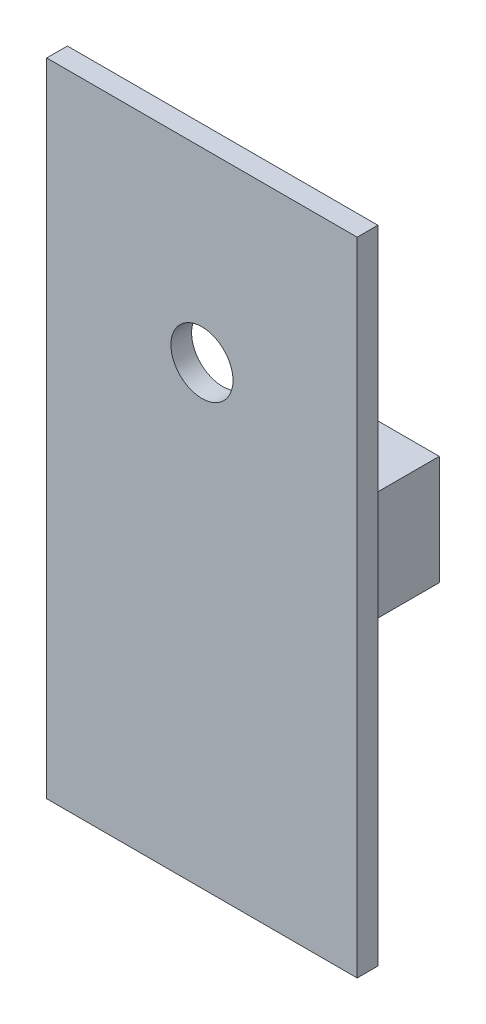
ISO-10303-21;
HEADER;
FILE_DESCRIPTION(('STEP AP214'),'2;1');
FILE_NAME('part.step','',(''),(''),'','','');
FILE_SCHEMA(('AUTOMOTIVE_DESIGN { 1 0 10303 214 1 1 1 1 }'));
ENDSEC;
DATA;
#1=APPLICATION_CONTEXT('core data for automotive mechanical design processes');
#2=APPLICATION_PROTOCOL_DEFINITION('international standard','automotive_design',2000,#1);
#3=PRODUCT_CONTEXT('',#1,'mechanical');
#4=PRODUCT('Part','Part','',(#3));
#5=PRODUCT_RELATED_PRODUCT_CATEGORY('part','',(#4));
#6=PRODUCT_DEFINITION_FORMATION('','',#4);
#7=PRODUCT_DEFINITION_CONTEXT('part definition',#1,'design');
#8=PRODUCT_DEFINITION('design','',#6,#7);
#9=PRODUCT_DEFINITION_SHAPE('','',#8);
#10=(LENGTH_UNIT() NAMED_UNIT(*) SI_UNIT(.MILLI.,.METRE.));
#11=(NAMED_UNIT(*) PLANE_ANGLE_UNIT() SI_UNIT($,.RADIAN.));
#12=(NAMED_UNIT(*) SI_UNIT($,.STERADIAN.) SOLID_ANGLE_UNIT());
#13=UNCERTAINTY_MEASURE_WITH_UNIT(LENGTH_MEASURE(1.E-05),#10,'distance_accuracy_value','');
#14=(GEOMETRIC_REPRESENTATION_CONTEXT(3) GLOBAL_UNCERTAINTY_ASSIGNED_CONTEXT((#13)) GLOBAL_UNIT_ASSIGNED_CONTEXT((#10,
#11,#12)) REPRESENTATION_CONTEXT('',''));
#15=CARTESIAN_POINT('',(0.,0.,0.));
#16=DIRECTION('',(0.,0.,1.));
#17=DIRECTION('',(1.,0.,0.));
#18=AXIS2_PLACEMENT_3D('',#15,#16,#17);
#19=CARTESIAN_POINT('',(0.,0.,0.));
#20=DIRECTION('',(0.,0.,1.));
#21=DIRECTION('',(1.,0.,0.));
#22=AXIS2_PLACEMENT_3D('',#19,#20,#21);
#23=PLANE('',#22);
#24=CARTESIAN_POINT('',(-0.516055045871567,-4.4243119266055,0.));
#25=DIRECTION('',(0.,0.,1.));
#26=DIRECTION('',(1.,0.,0.));
#27=AXIS2_PLACEMENT_3D('',#24,#25,#26);
#28=CIRCLE('',#27,1.5);
#29=CARTESIAN_POINT('',(0.983944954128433,-4.4243119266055,0.));
#30=VERTEX_POINT('',#29);
#31=EDGE_CURVE('E121',#30,#30,#28,.T.);
#32=ORIENTED_EDGE('',*,*,#31,.T.);
#33=EDGE_LOOP('',(#32));
#34=FACE_BOUND('',#33,.T.);
#35=DIRECTION('',(0.,-1.,0.));
#36=VECTOR('',#35,1.);
#37=CARTESIAN_POINT('',(-8.01605504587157,4.5756880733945,0.));
#38=LINE('',#37,#36);
#39=CARTESIAN_POINT('',(-8.01605504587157,4.5756880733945,0.));
#40=VERTEX_POINT('',#39);
#41=CARTESIAN_POINT('',(-8.01605504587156,-26.4243119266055,0.));
#42=VERTEX_POINT('',#41);
#43=EDGE_CURVE('E131',#40,#42,#38,.T.);
#44=ORIENTED_EDGE('',*,*,#43,.F.);
#45=DIRECTION('',(-1.,0.,0.));
#46=VECTOR('',#45,1.);
#47=CARTESIAN_POINT('',(-8.01605504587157,4.5756880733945,0.));
#48=LINE('',#47,#46);
#49=CARTESIAN_POINT('',(6.98394495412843,4.5756880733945,0.));
#50=VERTEX_POINT('',#49);
#51=EDGE_CURVE('E137',#50,#40,#48,.T.);
#52=ORIENTED_EDGE('',*,*,#51,.F.);
#53=DIRECTION('',(0.,1.,0.));
#54=VECTOR('',#53,1.);
#55=CARTESIAN_POINT('',(6.98394495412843,4.5756880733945,0.));
#56=LINE('',#55,#54);
#57=CARTESIAN_POINT('',(6.98394495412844,-26.4243119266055,0.));
#58=VERTEX_POINT('',#57);
#59=EDGE_CURVE('E148',#58,#50,#56,.T.);
#60=ORIENTED_EDGE('',*,*,#59,.F.);
#61=DIRECTION('',(1.,0.,0.));
#62=VECTOR('',#61,1.);
#63=CARTESIAN_POINT('',(-8.01605504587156,-26.4243119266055,0.));
#64=LINE('',#63,#62);
#65=EDGE_CURVE('E146',#42,#58,#64,.T.);
#66=ORIENTED_EDGE('',*,*,#65,.F.);
#67=EDGE_LOOP('',(#44,#52,#60,#66));
#68=FACE_BOUND('',#67,.T.);
#69=DIRECTION('',(0.,-1.,0.));
#70=VECTOR('',#69,1.);
#71=CARTESIAN_POINT('',(5.95187512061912,-7.61131936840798,0.));
#72=LINE('',#71,#70);
#73=CARTESIAN_POINT('',(5.95187512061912,-7.61131936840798,0.));
#74=VERTEX_POINT('',#73);
#75=CARTESIAN_POINT('',(5.95187512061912,-12.8970993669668,0.));
#76=VERTEX_POINT('',#75);
#77=EDGE_CURVE('E120',#74,#76,#72,.T.);
#78=ORIENTED_EDGE('',*,*,#77,.F.);
#79=DIRECTION('',(1.,0.,0.));
#80=VECTOR('',#79,1.);
#81=CARTESIAN_POINT('',(5.95187512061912,-7.61131936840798,0.));
#82=LINE('',#81,#80);
#83=CARTESIAN_POINT('',(1.08613818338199,-7.61131936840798,0.));
#84=VERTEX_POINT('',#83);
#85=EDGE_CURVE('E117',#84,#74,#82,.T.);
#86=ORIENTED_EDGE('',*,*,#85,.F.);
#87=DIRECTION('',(0.,1.,0.));
#88=VECTOR('',#87,1.);
#89=CARTESIAN_POINT('',(1.08613818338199,-7.61131936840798,0.));
#90=LINE('',#89,#88);
#91=CARTESIAN_POINT('',(1.08613818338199,-12.8970993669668,0.));
#92=VERTEX_POINT('',#91);
#93=EDGE_CURVE('E55',#92,#84,#90,.T.);
#94=ORIENTED_EDGE('',*,*,#93,.F.);
#95=DIRECTION('',(-1.,0.,0.));
#96=VECTOR('',#95,1.);
#97=CARTESIAN_POINT('',(5.95187512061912,-12.8970993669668,0.));
#98=LINE('',#97,#96);
#99=EDGE_CURVE('E50',#76,#92,#98,.T.);
#100=ORIENTED_EDGE('',*,*,#99,.F.);
#101=EDGE_LOOP('',(#78,#86,#94,#100));
#102=FACE_BOUND('',#101,.T.);
#103=ADVANCED_FACE('F35',(#34,#68,#102),#23,.F.);
#104=CARTESIAN_POINT('',(0.,0.,1.));
#105=DIRECTION('',(0.,0.,1.));
#106=DIRECTION('',(1.,0.,0.));
#107=AXIS2_PLACEMENT_3D('',#104,#105,#106);
#108=PLANE('',#107);
#109=DIRECTION('',(0.,-1.,0.));
#110=VECTOR('',#109,1.);
#111=CARTESIAN_POINT('',(-8.01605504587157,4.5756880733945,1.));
#112=LINE('',#111,#110);
#113=CARTESIAN_POINT('',(-8.01605504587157,4.5756880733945,1.));
#114=VERTEX_POINT('',#113);
#115=CARTESIAN_POINT('',(-8.01605504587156,-26.4243119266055,1.));
#116=VERTEX_POINT('',#115);
#117=EDGE_CURVE('E133',#114,#116,#112,.T.);
#118=ORIENTED_EDGE('',*,*,#117,.T.);
#119=DIRECTION('',(1.,0.,0.));
#120=VECTOR('',#119,1.);
#121=CARTESIAN_POINT('',(-8.01605504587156,-26.4243119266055,1.));
#122=LINE('',#121,#120);
#123=CARTESIAN_POINT('',(6.98394495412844,-26.4243119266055,1.));
#124=VERTEX_POINT('',#123);
#125=EDGE_CURVE('E136',#116,#124,#122,.T.);
#126=ORIENTED_EDGE('',*,*,#125,.T.);
#127=DIRECTION('',(0.,1.,0.));
#128=VECTOR('',#127,1.);
#129=CARTESIAN_POINT('',(6.98394495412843,4.5756880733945,1.));
#130=LINE('',#129,#128);
#131=CARTESIAN_POINT('',(6.98394495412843,4.5756880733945,1.));
#132=VERTEX_POINT('',#131);
#133=EDGE_CURVE('E139',#124,#132,#130,.T.);
#134=ORIENTED_EDGE('',*,*,#133,.T.);
#135=DIRECTION('',(-1.,0.,0.));
#136=VECTOR('',#135,1.);
#137=CARTESIAN_POINT('',(-8.01605504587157,4.5756880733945,1.));
#138=LINE('',#137,#136);
#139=EDGE_CURVE('E141',#132,#114,#138,.T.);
#140=ORIENTED_EDGE('',*,*,#139,.T.);
#141=EDGE_LOOP('',(#118,#126,#134,#140));
#142=FACE_BOUND('',#141,.T.);
#143=CARTESIAN_POINT('',(-0.516055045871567,-4.4243119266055,1.));
#144=DIRECTION('',(0.,0.,1.));
#145=DIRECTION('',(1.,0.,0.));
#146=AXIS2_PLACEMENT_3D('',#143,#144,#145);
#147=CIRCLE('',#146,1.5);
#148=CARTESIAN_POINT('',(0.983944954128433,-4.4243119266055,1.));
#149=VERTEX_POINT('',#148);
#150=EDGE_CURVE('E124',#149,#149,#147,.T.);
#151=ORIENTED_EDGE('',*,*,#150,.F.);
#152=EDGE_LOOP('',(#151));
#153=FACE_BOUND('',#152,.T.);
#154=ADVANCED_FACE('F174',(#142,#153),#108,.T.);
#155=CARTESIAN_POINT('',(-8.01605504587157,4.5756880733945,1.));
#156=DIRECTION('',(1.,0.,0.));
#157=DIRECTION('',(0.,1.,0.));
#158=AXIS2_PLACEMENT_3D('',#155,#156,#157);
#159=PLANE('',#158);
#160=ORIENTED_EDGE('',*,*,#43,.T.);
#161=DIRECTION('',(0.,0.,-1.));
#162=VECTOR('',#161,1.);
#163=CARTESIAN_POINT('',(-8.01605504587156,-26.4243119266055,1.));
#164=LINE('',#163,#162);
#165=EDGE_CURVE('E11',#116,#42,#164,.T.);
#166=ORIENTED_EDGE('',*,*,#165,.F.);
#167=ORIENTED_EDGE('',*,*,#117,.F.);
#168=DIRECTION('',(0.,0.,-1.));
#169=VECTOR('',#168,1.);
#170=CARTESIAN_POINT('',(-8.01605504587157,4.5756880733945,1.));
#171=LINE('',#170,#169);
#172=EDGE_CURVE('E143',#114,#40,#171,.T.);
#173=ORIENTED_EDGE('',*,*,#172,.T.);
#174=EDGE_LOOP('',(#160,#166,#167,#173));
#175=FACE_BOUND('',#174,.T.);
#176=ADVANCED_FACE('F37',(#175),#159,.F.);
#177=CARTESIAN_POINT('',(-8.01605504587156,-26.4243119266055,1.));
#178=DIRECTION('',(0.,1.,0.));
#179=DIRECTION('',(0.,0.,1.));
#180=AXIS2_PLACEMENT_3D('',#177,#178,#179);
#181=PLANE('',#180);
#182=ORIENTED_EDGE('',*,*,#65,.T.);
#183=DIRECTION('',(0.,0.,-1.));
#184=VECTOR('',#183,1.);
#185=CARTESIAN_POINT('',(6.98394495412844,-26.4243119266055,1.));
#186=LINE('',#185,#184);
#187=EDGE_CURVE('E43',#124,#58,#186,.T.);
#188=ORIENTED_EDGE('',*,*,#187,.F.);
#189=ORIENTED_EDGE('',*,*,#125,.F.);
#190=ORIENTED_EDGE('',*,*,#165,.T.);
#191=EDGE_LOOP('',(#182,#188,#189,#190));
#192=FACE_BOUND('',#191,.T.);
#193=ADVANCED_FACE('F176',(#192),#181,.F.);
#194=CARTESIAN_POINT('',(6.98394495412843,4.5756880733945,1.));
#195=DIRECTION('',(-1.,0.,0.));
#196=DIRECTION('',(0.,-1.,0.));
#197=AXIS2_PLACEMENT_3D('',#194,#195,#196);
#198=PLANE('',#197);
#199=ORIENTED_EDGE('',*,*,#59,.T.);
#200=DIRECTION('',(0.,0.,-1.));
#201=VECTOR('',#200,1.);
#202=CARTESIAN_POINT('',(6.98394495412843,4.5756880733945,1.));
#203=LINE('',#202,#201);
#204=EDGE_CURVE('E153',#132,#50,#203,.T.);
#205=ORIENTED_EDGE('',*,*,#204,.F.);
#206=ORIENTED_EDGE('',*,*,#133,.F.);
#207=ORIENTED_EDGE('',*,*,#187,.T.);
#208=EDGE_LOOP('',(#199,#205,#206,#207));
#209=FACE_BOUND('',#208,.T.);
#210=ADVANCED_FACE('F160',(#209),#198,.F.);
#211=CARTESIAN_POINT('',(-8.01605504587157,4.5756880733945,1.));
#212=DIRECTION('',(0.,-1.,0.));
#213=DIRECTION('',(0.,0.,-1.));
#214=AXIS2_PLACEMENT_3D('',#211,#212,#213);
#215=PLANE('',#214);
#216=ORIENTED_EDGE('',*,*,#51,.T.);
#217=ORIENTED_EDGE('',*,*,#172,.F.);
#218=ORIENTED_EDGE('',*,*,#139,.F.);
#219=ORIENTED_EDGE('',*,*,#204,.T.);
#220=EDGE_LOOP('',(#216,#217,#218,#219));
#221=FACE_BOUND('',#220,.T.);
#222=ADVANCED_FACE('F168',(#221),#215,.F.);
#223=CARTESIAN_POINT('',(-0.516055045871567,-4.4243119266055,1.));
#224=DIRECTION('',(0.,0.,-1.));
#225=DIRECTION('',(-1.,0.,0.));
#226=AXIS2_PLACEMENT_3D('',#223,#224,#225);
#227=CYLINDRICAL_SURFACE('',#226,1.5);
#228=ORIENTED_EDGE('',*,*,#150,.T.);
#229=EDGE_LOOP('',(#228));
#230=FACE_BOUND('',#229,.T.);
#231=ORIENTED_EDGE('',*,*,#31,.F.);
#232=EDGE_LOOP('',(#231));
#233=FACE_BOUND('',#232,.T.);
#234=ADVANCED_FACE('F193',(#230,#233),#227,.F.);
#235=CARTESIAN_POINT('',(5.95187512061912,-7.61131936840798,-4.));
#236=DIRECTION('',(-1.,0.,0.));
#237=DIRECTION('',(0.,0.,1.));
#238=AXIS2_PLACEMENT_3D('',#235,#236,#237);
#239=PLANE('',#238);
#240=ORIENTED_EDGE('',*,*,#77,.T.);
#241=DIRECTION('',(0.,0.,1.));
#242=VECTOR('',#241,1.);
#243=CARTESIAN_POINT('',(5.95187512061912,-12.8970993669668,-4.));
#244=LINE('',#243,#242);
#245=CARTESIAN_POINT('',(5.95187512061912,-12.8970993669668,-4.));
#246=VERTEX_POINT('',#245);
#247=EDGE_CURVE('E101',#246,#76,#244,.T.);
#248=ORIENTED_EDGE('',*,*,#247,.F.);
#249=DIRECTION('',(0.,-1.,0.));
#250=VECTOR('',#249,1.);
#251=CARTESIAN_POINT('',(5.95187512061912,-7.61131936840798,-4.));
#252=LINE('',#251,#250);
#253=CARTESIAN_POINT('',(5.95187512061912,-7.61131936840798,-4.));
#254=VERTEX_POINT('',#253);
#255=EDGE_CURVE('E108',#254,#246,#252,.T.);
#256=ORIENTED_EDGE('',*,*,#255,.F.);
#257=DIRECTION('',(0.,0.,1.));
#258=VECTOR('',#257,1.);
#259=CARTESIAN_POINT('',(5.95187512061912,-7.61131936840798,-4.));
#260=LINE('',#259,#258);
#261=EDGE_CURVE('E281',#254,#74,#260,.T.);
#262=ORIENTED_EDGE('',*,*,#261,.T.);
#263=EDGE_LOOP('',(#240,#248,#256,#262));
#264=FACE_BOUND('',#263,.T.);
#265=ADVANCED_FACE('F119',(#264),#239,.F.);
#266=CARTESIAN_POINT('',(5.95187512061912,-12.8970993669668,-4.));
#267=DIRECTION('',(0.,1.,0.));
#268=DIRECTION('',(0.,0.,1.));
#269=AXIS2_PLACEMENT_3D('',#266,#267,#268);
#270=PLANE('',#269);
#271=ORIENTED_EDGE('',*,*,#99,.T.);
#272=DIRECTION('',(0.,0.,1.));
#273=VECTOR('',#272,1.);
#274=CARTESIAN_POINT('',(1.08613818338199,-12.8970993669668,-4.));
#275=LINE('',#274,#273);
#276=CARTESIAN_POINT('',(1.08613818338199,-12.8970993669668,-4.));
#277=VERTEX_POINT('',#276);
#278=EDGE_CURVE('E104',#277,#92,#275,.T.);
#279=ORIENTED_EDGE('',*,*,#278,.F.);
#280=DIRECTION('',(-1.,0.,0.));
#281=VECTOR('',#280,1.);
#282=CARTESIAN_POINT('',(5.95187512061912,-12.8970993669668,-4.));
#283=LINE('',#282,#281);
#284=EDGE_CURVE('E97',#246,#277,#283,.T.);
#285=ORIENTED_EDGE('',*,*,#284,.F.);
#286=ORIENTED_EDGE('',*,*,#247,.T.);
#287=EDGE_LOOP('',(#271,#279,#285,#286));
#288=FACE_BOUND('',#287,.T.);
#289=ADVANCED_FACE('F99',(#288),#270,.F.);
#290=CARTESIAN_POINT('',(1.08613818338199,-7.61131936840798,-4.));
#291=DIRECTION('',(1.,0.,0.));
#292=DIRECTION('',(0.,0.,-1.));
#293=AXIS2_PLACEMENT_3D('',#290,#291,#292);
#294=PLANE('',#293);
#295=ORIENTED_EDGE('',*,*,#93,.T.);
#296=DIRECTION('',(0.,0.,1.));
#297=VECTOR('',#296,1.);
#298=CARTESIAN_POINT('',(1.08613818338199,-7.61131936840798,-4.));
#299=LINE('',#298,#297);
#300=CARTESIAN_POINT('',(1.08613818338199,-7.61131936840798,-4.));
#301=VERTEX_POINT('',#300);
#302=EDGE_CURVE('E126',#301,#84,#299,.T.);
#303=ORIENTED_EDGE('',*,*,#302,.F.);
#304=DIRECTION('',(0.,1.,0.));
#305=VECTOR('',#304,1.);
#306=CARTESIAN_POINT('',(1.08613818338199,-7.61131936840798,-4.));
#307=LINE('',#306,#305);
#308=EDGE_CURVE('E107',#277,#301,#307,.T.);
#309=ORIENTED_EDGE('',*,*,#308,.F.);
#310=ORIENTED_EDGE('',*,*,#278,.T.);
#311=EDGE_LOOP('',(#295,#303,#309,#310));
#312=FACE_BOUND('',#311,.T.);
#313=ADVANCED_FACE('F206',(#312),#294,.F.);
#314=CARTESIAN_POINT('',(5.95187512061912,-7.61131936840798,-4.));
#315=DIRECTION('',(0.,-1.,0.));
#316=DIRECTION('',(0.,0.,-1.));
#317=AXIS2_PLACEMENT_3D('',#314,#315,#316);
#318=PLANE('',#317);
#319=ORIENTED_EDGE('',*,*,#85,.T.);
#320=ORIENTED_EDGE('',*,*,#261,.F.);
#321=DIRECTION('',(1.,0.,0.));
#322=VECTOR('',#321,1.);
#323=CARTESIAN_POINT('',(5.95187512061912,-7.61131936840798,-4.));
#324=LINE('',#323,#322);
#325=EDGE_CURVE('E113',#301,#254,#324,.T.);
#326=ORIENTED_EDGE('',*,*,#325,.F.);
#327=ORIENTED_EDGE('',*,*,#302,.T.);
#328=EDGE_LOOP('',(#319,#320,#326,#327));
#329=FACE_BOUND('',#328,.T.);
#330=ADVANCED_FACE('F209',(#329),#318,.F.);
#331=CARTESIAN_POINT('',(0.,0.,-4.));
#332=DIRECTION('',(0.,0.,-1.));
#333=DIRECTION('',(-1.,0.,0.));
#334=AXIS2_PLACEMENT_3D('',#331,#332,#333);
#335=PLANE('',#334);
#336=ORIENTED_EDGE('',*,*,#255,.T.);
#337=ORIENTED_EDGE('',*,*,#284,.T.);
#338=ORIENTED_EDGE('',*,*,#308,.T.);
#339=ORIENTED_EDGE('',*,*,#325,.T.);
#340=EDGE_LOOP('',(#336,#337,#338,#339));
#341=FACE_BOUND('',#340,.T.);
#342=ADVANCED_FACE('F111',(#341),#335,.T.);
#343=CLOSED_SHELL('',(#103,#154,#176,#193,#210,#222,#234,#265,#289,#313,#330,#342));
#344=MANIFOLD_SOLID_BREP('B2',#343);
#345=ADVANCED_BREP_SHAPE_REPRESENTATION('',(#18,#344),#14);
#346=SHAPE_DEFINITION_REPRESENTATION(#9,#345);
ENDSEC;
END-ISO-10303-21;
